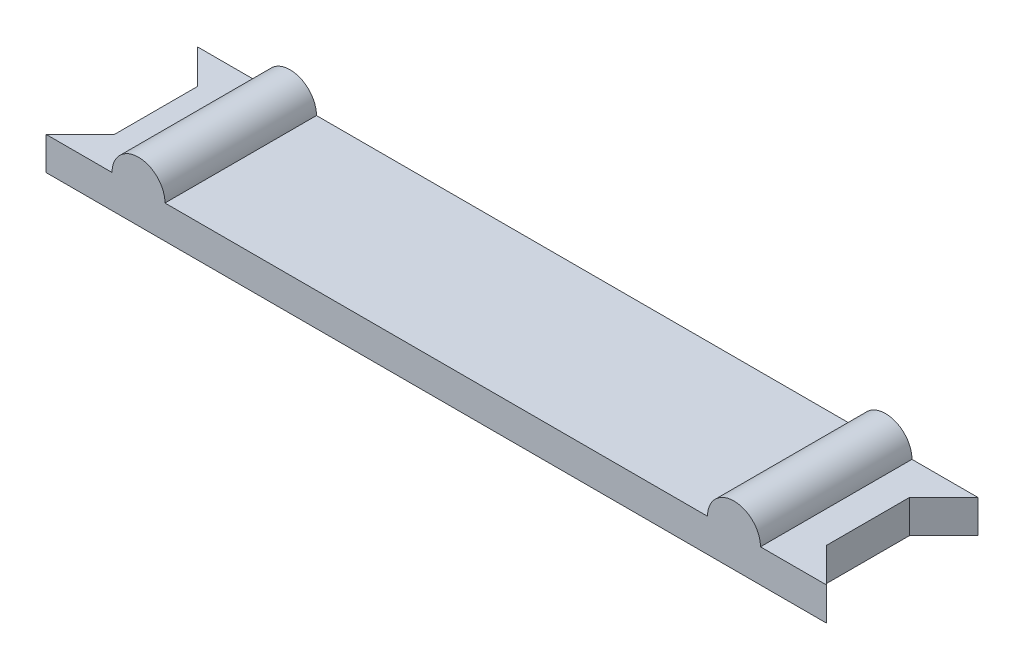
ISO-10303-21;
HEADER;
FILE_DESCRIPTION(('STEP AP214'),'2;1');
FILE_NAME('part.step','',(''),(''),'','','');
FILE_SCHEMA(('AUTOMOTIVE_DESIGN { 1 0 10303 214 1 1 1 1 }'));
ENDSEC;
DATA;
#1=APPLICATION_CONTEXT('core data for automotive mechanical design processes');
#2=APPLICATION_PROTOCOL_DEFINITION('international standard','automotive_design',2000,#1);
#3=PRODUCT_CONTEXT('',#1,'mechanical');
#4=PRODUCT('Part','Part','',(#3));
#5=PRODUCT_RELATED_PRODUCT_CATEGORY('part','',(#4));
#6=PRODUCT_DEFINITION_FORMATION('','',#4);
#7=PRODUCT_DEFINITION_CONTEXT('part definition',#1,'design');
#8=PRODUCT_DEFINITION('design','',#6,#7);
#9=PRODUCT_DEFINITION_SHAPE('','',#8);
#10=(LENGTH_UNIT() NAMED_UNIT(*) SI_UNIT(.MILLI.,.METRE.));
#11=(NAMED_UNIT(*) PLANE_ANGLE_UNIT() SI_UNIT($,.RADIAN.));
#12=(NAMED_UNIT(*) SI_UNIT($,.STERADIAN.) SOLID_ANGLE_UNIT());
#13=UNCERTAINTY_MEASURE_WITH_UNIT(LENGTH_MEASURE(1.E-05),#10,'distance_accuracy_value','');
#14=(GEOMETRIC_REPRESENTATION_CONTEXT(3) GLOBAL_UNCERTAINTY_ASSIGNED_CONTEXT((#13)) GLOBAL_UNIT_ASSIGNED_CONTEXT((#10,
#11,#12)) REPRESENTATION_CONTEXT('',''));
#15=CARTESIAN_POINT('',(0.,0.,0.));
#16=DIRECTION('',(0.,0.,1.));
#17=DIRECTION('',(1.,0.,0.));
#18=AXIS2_PLACEMENT_3D('',#15,#16,#17);
#19=CARTESIAN_POINT('',(0.,2.5,0.));
#20=DIRECTION('',(0.,1.,0.));
#21=DIRECTION('',(0.,0.,1.));
#22=AXIS2_PLACEMENT_3D('',#19,#20,#21);
#23=PLANE('',#22);
#24=DIRECTION('',(0.,0.,1.));
#25=VECTOR('',#24,1.);
#26=CARTESIAN_POINT('',(20.5,2.5,-10.1971359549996));
#27=LINE('',#26,#25);
#28=CARTESIAN_POINT('',(20.5,2.5,-5.725));
#29=VERTEX_POINT('',#28);
#30=CARTESIAN_POINT('',(20.5,2.5,5.725));
#31=VERTEX_POINT('',#30);
#32=EDGE_CURVE('E183',#29,#31,#27,.T.);
#33=ORIENTED_EDGE('',*,*,#32,.F.);
#34=DIRECTION('',(1.,0.,0.));
#35=VECTOR('',#34,1.);
#36=CARTESIAN_POINT('',(0.,2.5,-5.725));
#37=LINE('',#36,#35);
#38=CARTESIAN_POINT('',(-20.5,2.5,-5.725));
#39=VERTEX_POINT('',#38);
#40=EDGE_CURVE('E171',#39,#29,#37,.T.);
#41=ORIENTED_EDGE('',*,*,#40,.F.);
#42=DIRECTION('',(0.,0.,1.));
#43=VECTOR('',#42,1.);
#44=CARTESIAN_POINT('',(-20.5,2.5,-10.1971359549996));
#45=LINE('',#44,#43);
#46=CARTESIAN_POINT('',(-20.5,2.5,5.725));
#47=VERTEX_POINT('',#46);
#48=EDGE_CURVE('E206',#39,#47,#45,.T.);
#49=ORIENTED_EDGE('',*,*,#48,.T.);
#50=DIRECTION('',(1.,0.,0.));
#51=VECTOR('',#50,1.);
#52=CARTESIAN_POINT('',(0.,2.5,5.725));
#53=LINE('',#52,#51);
#54=EDGE_CURVE('E237',#47,#31,#53,.T.);
#55=ORIENTED_EDGE('',*,*,#54,.T.);
#56=EDGE_LOOP('',(#33,#41,#49,#55));
#57=FACE_BOUND('',#56,.T.);
#58=ADVANCED_FACE('F45',(#57),#23,.T.);
#59=DIRECTION('',(0.,0.,1.));
#60=VECTOR('',#59,1.);
#61=CARTESIAN_POINT('',(-24.5,2.5,-10.1971359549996));
#62=LINE('',#61,#60);
#63=CARTESIAN_POINT('',(-24.5,2.5,-5.725));
#64=VERTEX_POINT('',#63);
#65=CARTESIAN_POINT('',(-24.5,2.5,5.725));
#66=VERTEX_POINT('',#65);
#67=EDGE_CURVE('E202',#64,#66,#62,.T.);
#68=ORIENTED_EDGE('',*,*,#67,.F.);
#69=CARTESIAN_POINT('',(-29.4910181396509,2.5,-5.725));
#70=VERTEX_POINT('',#69);
#71=EDGE_CURVE('E173',#70,#64,#37,.T.);
#72=ORIENTED_EDGE('',*,*,#71,.F.);
#73=DIRECTION('',(0.707928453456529,0.,0.706284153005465));
#74=VECTOR('',#73,1.);
#75=CARTESIAN_POINT('',(-11.8487277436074,2.5,11.8763127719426));
#76=LINE('',#75,#74);
#77=CARTESIAN_POINT('',(-26.9,2.5,-3.14));
#78=VERTEX_POINT('',#77);
#79=EDGE_CURVE('E223',#70,#78,#76,.T.);
#80=ORIENTED_EDGE('',*,*,#79,.T.);
#81=DIRECTION('',(0.,0.,1.));
#82=VECTOR('',#81,1.);
#83=CARTESIAN_POINT('',(-26.9,2.5,0.));
#84=LINE('',#83,#82);
#85=CARTESIAN_POINT('',(-26.9,2.5,3.14));
#86=VERTEX_POINT('',#85);
#87=EDGE_CURVE('E226',#78,#86,#84,.T.);
#88=ORIENTED_EDGE('',*,*,#87,.T.);
#89=DIRECTION('',(-0.707928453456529,0.,0.706284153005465));
#90=VECTOR('',#89,1.);
#91=CARTESIAN_POINT('',(-11.8487277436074,2.5,-11.8763127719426));
#92=LINE('',#91,#90);
#93=CARTESIAN_POINT('',(-29.4910181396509,2.5,5.725));
#94=VERTEX_POINT('',#93);
#95=EDGE_CURVE('E229',#86,#94,#92,.T.);
#96=ORIENTED_EDGE('',*,*,#95,.T.);
#97=EDGE_CURVE('E233',#94,#66,#53,.T.);
#98=ORIENTED_EDGE('',*,*,#97,.T.);
#99=EDGE_LOOP('',(#68,#72,#80,#88,#96,#98));
#100=FACE_BOUND('',#99,.T.);
#101=ADVANCED_FACE('F351',(#100),#23,.T.);
#102=CARTESIAN_POINT('',(11.8487277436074,2.5,-11.8763127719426));
#103=DIRECTION('',(0.706284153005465,0.,-0.707928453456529));
#104=DIRECTION('',(-0.707928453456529,0.,-0.706284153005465));
#105=AXIS2_PLACEMENT_3D('',#102,#103,#104);
#106=PLANE('',#105);
#107=DIRECTION('',(0.707928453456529,0.,0.706284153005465));
#108=VECTOR('',#107,1.);
#109=CARTESIAN_POINT('',(11.8487277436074,0.,-11.8763127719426));
#110=LINE('',#109,#108);
#111=CARTESIAN_POINT('',(26.9,0.,3.14));
#112=VERTEX_POINT('',#111);
#113=CARTESIAN_POINT('',(29.4910181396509,0.,5.725));
#114=VERTEX_POINT('',#113);
#115=EDGE_CURVE('E209',#112,#114,#110,.T.);
#116=ORIENTED_EDGE('',*,*,#115,.F.);
#117=DIRECTION('',(0.,-1.,0.));
#118=VECTOR('',#117,1.);
#119=CARTESIAN_POINT('',(26.9,2.5,3.14));
#120=LINE('',#119,#118);
#121=CARTESIAN_POINT('',(26.9,2.5,3.14));
#122=VERTEX_POINT('',#121);
#123=EDGE_CURVE('E288',#122,#112,#120,.T.);
#124=ORIENTED_EDGE('',*,*,#123,.F.);
#125=DIRECTION('',(0.707928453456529,0.,0.706284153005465));
#126=VECTOR('',#125,1.);
#127=CARTESIAN_POINT('',(11.8487277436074,2.5,-11.8763127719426));
#128=LINE('',#127,#126);
#129=CARTESIAN_POINT('',(29.4910181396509,2.5,5.725));
#130=VERTEX_POINT('',#129);
#131=EDGE_CURVE('E210',#122,#130,#128,.T.);
#132=ORIENTED_EDGE('',*,*,#131,.T.);
#133=DIRECTION('',(0.,-1.,0.));
#134=VECTOR('',#133,1.);
#135=CARTESIAN_POINT('',(29.4910181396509,2.5,5.725));
#136=LINE('',#135,#134);
#137=EDGE_CURVE('E236',#130,#114,#136,.T.);
#138=ORIENTED_EDGE('',*,*,#137,.T.);
#139=EDGE_LOOP('',(#116,#124,#132,#138));
#140=FACE_BOUND('',#139,.T.);
#141=ADVANCED_FACE('F364',(#140),#106,.T.);
#142=CARTESIAN_POINT('',(26.9,2.5,0.));
#143=DIRECTION('',(1.,0.,0.));
#144=DIRECTION('',(0.,0.,-1.));
#145=AXIS2_PLACEMENT_3D('',#142,#143,#144);
#146=PLANE('',#145);
#147=DIRECTION('',(0.,0.,1.));
#148=VECTOR('',#147,1.);
#149=CARTESIAN_POINT('',(26.9,0.,0.));
#150=LINE('',#149,#148);
#151=CARTESIAN_POINT('',(26.9,0.,-3.13999999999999));
#152=VERTEX_POINT('',#151);
#153=EDGE_CURVE('E241',#152,#112,#150,.T.);
#154=ORIENTED_EDGE('',*,*,#153,.F.);
#155=DIRECTION('',(0.,-1.,0.));
#156=VECTOR('',#155,1.);
#157=CARTESIAN_POINT('',(26.9,2.5,-3.13999999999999));
#158=LINE('',#157,#156);
#159=CARTESIAN_POINT('',(26.9,2.5,-3.13999999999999));
#160=VERTEX_POINT('',#159);
#161=EDGE_CURVE('E285',#160,#152,#158,.T.);
#162=ORIENTED_EDGE('',*,*,#161,.F.);
#163=DIRECTION('',(0.,0.,1.));
#164=VECTOR('',#163,1.);
#165=CARTESIAN_POINT('',(26.9,2.5,0.));
#166=LINE('',#165,#164);
#167=EDGE_CURVE('E214',#160,#122,#166,.T.);
#168=ORIENTED_EDGE('',*,*,#167,.T.);
#169=ORIENTED_EDGE('',*,*,#123,.T.);
#170=EDGE_LOOP('',(#154,#162,#168,#169));
#171=FACE_BOUND('',#170,.T.);
#172=ADVANCED_FACE('F366',(#171),#146,.T.);
#173=CARTESIAN_POINT('',(11.8487277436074,2.5,11.8763127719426));
#174=DIRECTION('',(0.706284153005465,0.,0.707928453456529));
#175=DIRECTION('',(0.707928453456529,0.,-0.706284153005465));
#176=AXIS2_PLACEMENT_3D('',#173,#174,#175);
#177=PLANE('',#176);
#178=DIRECTION('',(-0.707928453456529,0.,0.706284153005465));
#179=VECTOR('',#178,1.);
#180=CARTESIAN_POINT('',(11.8487277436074,0.,11.8763127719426));
#181=LINE('',#180,#179);
#182=CARTESIAN_POINT('',(29.4910181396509,0.,-5.725));
#183=VERTEX_POINT('',#182);
#184=EDGE_CURVE('E245',#183,#152,#181,.T.);
#185=ORIENTED_EDGE('',*,*,#184,.F.);
#186=DIRECTION('',(0.,-1.,0.));
#187=VECTOR('',#186,1.);
#188=CARTESIAN_POINT('',(29.4910181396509,2.5,-5.725));
#189=LINE('',#188,#187);
#190=CARTESIAN_POINT('',(29.4910181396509,2.5,-5.725));
#191=VERTEX_POINT('',#190);
#192=EDGE_CURVE('E282',#191,#183,#189,.T.);
#193=ORIENTED_EDGE('',*,*,#192,.F.);
#194=DIRECTION('',(-0.707928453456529,0.,0.706284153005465));
#195=VECTOR('',#194,1.);
#196=CARTESIAN_POINT('',(11.8487277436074,2.5,11.8763127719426));
#197=LINE('',#196,#195);
#198=EDGE_CURVE('E167',#191,#160,#197,.T.);
#199=ORIENTED_EDGE('',*,*,#198,.T.);
#200=ORIENTED_EDGE('',*,*,#161,.T.);
#201=EDGE_LOOP('',(#185,#193,#199,#200));
#202=FACE_BOUND('',#201,.T.);
#203=ADVANCED_FACE('F369',(#202),#177,.T.);
#204=CARTESIAN_POINT('',(0.,2.5,-5.725));
#205=DIRECTION('',(0.,0.,-1.));
#206=DIRECTION('',(-1.,0.,0.));
#207=AXIS2_PLACEMENT_3D('',#204,#205,#206);
#208=PLANE('',#207);
#209=DIRECTION('',(1.,0.,0.));
#210=VECTOR('',#209,1.);
#211=CARTESIAN_POINT('',(0.,0.,-5.725));
#212=LINE('',#211,#210);
#213=CARTESIAN_POINT('',(-29.4910181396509,0.,-5.725));
#214=VERTEX_POINT('',#213);
#215=EDGE_CURVE('E249',#214,#183,#212,.T.);
#216=ORIENTED_EDGE('',*,*,#215,.F.);
#217=DIRECTION('',(0.,-1.,0.));
#218=VECTOR('',#217,1.);
#219=CARTESIAN_POINT('',(-29.4910181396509,2.5,-5.725));
#220=LINE('',#219,#218);
#221=EDGE_CURVE('E279',#70,#214,#220,.T.);
#222=ORIENTED_EDGE('',*,*,#221,.F.);
#223=ORIENTED_EDGE('',*,*,#71,.T.);
#224=CARTESIAN_POINT('',(-22.5,2.5,-5.725));
#225=DIRECTION('',(0.,0.,-1.));
#226=DIRECTION('',(-1.,0.,0.));
#227=AXIS2_PLACEMENT_3D('',#224,#225,#226);
#228=CIRCLE('',#227,2.);
#229=EDGE_CURVE('E195',#39,#64,#228,.F.);
#230=ORIENTED_EDGE('',*,*,#229,.F.);
#231=ORIENTED_EDGE('',*,*,#40,.T.);
#232=CARTESIAN_POINT('',(22.5,2.5,-5.725));
#233=DIRECTION('',(0.,0.,-1.));
#234=DIRECTION('',(-1.,0.,0.));
#235=AXIS2_PLACEMENT_3D('',#232,#233,#234);
#236=CIRCLE('',#235,2.);
#237=CARTESIAN_POINT('',(24.5,2.5,-5.725));
#238=VERTEX_POINT('',#237);
#239=EDGE_CURVE('E176',#238,#29,#236,.F.);
#240=ORIENTED_EDGE('',*,*,#239,.F.);
#241=EDGE_CURVE('E159',#238,#191,#37,.T.);
#242=ORIENTED_EDGE('',*,*,#241,.T.);
#243=ORIENTED_EDGE('',*,*,#192,.T.);
#244=EDGE_LOOP('',(#216,#222,#223,#230,#231,#240,#242,#243));
#245=FACE_BOUND('',#244,.T.);
#246=ADVANCED_FACE('F178',(#245),#208,.T.);
#247=CARTESIAN_POINT('',(-11.8487277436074,2.5,11.8763127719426));
#248=DIRECTION('',(0.706284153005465,0.,-0.707928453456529));
#249=DIRECTION('',(-0.707928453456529,0.,-0.706284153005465));
#250=AXIS2_PLACEMENT_3D('',#247,#248,#249);
#251=PLANE('',#250);
#252=DIRECTION('',(0.707928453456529,0.,0.706284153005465));
#253=VECTOR('',#252,1.);
#254=CARTESIAN_POINT('',(-11.8487277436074,0.,11.8763127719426));
#255=LINE('',#254,#253);
#256=CARTESIAN_POINT('',(-26.9,0.,-3.14));
#257=VERTEX_POINT('',#256);
#258=EDGE_CURVE('E253',#214,#257,#255,.T.);
#259=ORIENTED_EDGE('',*,*,#258,.T.);
#260=DIRECTION('',(0.,-1.,0.));
#261=VECTOR('',#260,1.);
#262=CARTESIAN_POINT('',(-26.9,2.5,-3.14));
#263=LINE('',#262,#261);
#264=EDGE_CURVE('E275',#78,#257,#263,.T.);
#265=ORIENTED_EDGE('',*,*,#264,.F.);
#266=ORIENTED_EDGE('',*,*,#79,.F.);
#267=ORIENTED_EDGE('',*,*,#221,.T.);
#268=EDGE_LOOP('',(#259,#265,#266,#267));
#269=FACE_BOUND('',#268,.T.);
#270=ADVANCED_FACE('F373',(#269),#251,.F.);
#271=CARTESIAN_POINT('',(-26.9,2.5,0.));
#272=DIRECTION('',(1.,0.,0.));
#273=DIRECTION('',(0.,0.,-1.));
#274=AXIS2_PLACEMENT_3D('',#271,#272,#273);
#275=PLANE('',#274);
#276=DIRECTION('',(0.,0.,1.));
#277=VECTOR('',#276,1.);
#278=CARTESIAN_POINT('',(-26.9,0.,0.));
#279=LINE('',#278,#277);
#280=CARTESIAN_POINT('',(-26.9,0.,3.14));
#281=VERTEX_POINT('',#280);
#282=EDGE_CURVE('E256',#257,#281,#279,.T.);
#283=ORIENTED_EDGE('',*,*,#282,.T.);
#284=DIRECTION('',(0.,-1.,0.));
#285=VECTOR('',#284,1.);
#286=CARTESIAN_POINT('',(-26.9,2.5,3.14));
#287=LINE('',#286,#285);
#288=EDGE_CURVE('E271',#86,#281,#287,.T.);
#289=ORIENTED_EDGE('',*,*,#288,.F.);
#290=ORIENTED_EDGE('',*,*,#87,.F.);
#291=ORIENTED_EDGE('',*,*,#264,.T.);
#292=EDGE_LOOP('',(#283,#289,#290,#291));
#293=FACE_BOUND('',#292,.T.);
#294=ADVANCED_FACE('F375',(#293),#275,.F.);
#295=CARTESIAN_POINT('',(-11.8487277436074,2.5,-11.8763127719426));
#296=DIRECTION('',(0.706284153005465,0.,0.707928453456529));
#297=DIRECTION('',(0.707928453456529,0.,-0.706284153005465));
#298=AXIS2_PLACEMENT_3D('',#295,#296,#297);
#299=PLANE('',#298);
#300=DIRECTION('',(-0.707928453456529,0.,0.706284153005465));
#301=VECTOR('',#300,1.);
#302=CARTESIAN_POINT('',(-11.8487277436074,0.,-11.8763127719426));
#303=LINE('',#302,#301);
#304=CARTESIAN_POINT('',(-29.4910181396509,0.,5.725));
#305=VERTEX_POINT('',#304);
#306=EDGE_CURVE('E259',#281,#305,#303,.T.);
#307=ORIENTED_EDGE('',*,*,#306,.T.);
#308=DIRECTION('',(0.,-1.,0.));
#309=VECTOR('',#308,1.);
#310=CARTESIAN_POINT('',(-29.4910181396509,2.5,5.725));
#311=LINE('',#310,#309);
#312=EDGE_CURVE('E267',#94,#305,#311,.T.);
#313=ORIENTED_EDGE('',*,*,#312,.F.);
#314=ORIENTED_EDGE('',*,*,#95,.F.);
#315=ORIENTED_EDGE('',*,*,#288,.T.);
#316=EDGE_LOOP('',(#307,#313,#314,#315));
#317=FACE_BOUND('',#316,.T.);
#318=ADVANCED_FACE('F357',(#317),#299,.F.);
#319=CARTESIAN_POINT('',(0.,2.5,5.725));
#320=DIRECTION('',(0.,0.,-1.));
#321=DIRECTION('',(-1.,0.,0.));
#322=AXIS2_PLACEMENT_3D('',#319,#320,#321);
#323=PLANE('',#322);
#324=DIRECTION('',(1.,0.,0.));
#325=VECTOR('',#324,1.);
#326=CARTESIAN_POINT('',(0.,0.,5.725));
#327=LINE('',#326,#325);
#328=EDGE_CURVE('E215',#305,#114,#327,.T.);
#329=ORIENTED_EDGE('',*,*,#328,.T.);
#330=ORIENTED_EDGE('',*,*,#137,.F.);
#331=CARTESIAN_POINT('',(24.5,2.5,5.725));
#332=VERTEX_POINT('',#331);
#333=EDGE_CURVE('E232',#332,#130,#53,.T.);
#334=ORIENTED_EDGE('',*,*,#333,.F.);
#335=CARTESIAN_POINT('',(22.5,2.5,5.725));
#336=DIRECTION('',(0.,0.,1.));
#337=DIRECTION('',(1.,0.,0.));
#338=AXIS2_PLACEMENT_3D('',#335,#336,#337);
#339=CIRCLE('',#338,2.);
#340=EDGE_CURVE('E184',#332,#31,#339,.T.);
#341=ORIENTED_EDGE('',*,*,#340,.T.);
#342=ORIENTED_EDGE('',*,*,#54,.F.);
#343=CARTESIAN_POINT('',(-22.5,2.5,5.725));
#344=DIRECTION('',(0.,0.,1.));
#345=DIRECTION('',(1.,0.,0.));
#346=AXIS2_PLACEMENT_3D('',#343,#344,#345);
#347=CIRCLE('',#346,2.);
#348=EDGE_CURVE('E190',#47,#66,#347,.T.);
#349=ORIENTED_EDGE('',*,*,#348,.T.);
#350=ORIENTED_EDGE('',*,*,#97,.F.);
#351=ORIENTED_EDGE('',*,*,#312,.T.);
#352=EDGE_LOOP('',(#329,#330,#334,#341,#342,#349,#350,#351));
#353=FACE_BOUND('',#352,.T.);
#354=ADVANCED_FACE('F337',(#353),#323,.F.);
#355=DIRECTION('',(0.,0.,1.));
#356=VECTOR('',#355,1.);
#357=CARTESIAN_POINT('',(24.5,2.5,-10.1971359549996));
#358=LINE('',#357,#356);
#359=EDGE_CURVE('E163',#238,#332,#358,.T.);
#360=ORIENTED_EDGE('',*,*,#359,.T.);
#361=ORIENTED_EDGE('',*,*,#333,.T.);
#362=ORIENTED_EDGE('',*,*,#131,.F.);
#363=ORIENTED_EDGE('',*,*,#167,.F.);
#364=ORIENTED_EDGE('',*,*,#198,.F.);
#365=ORIENTED_EDGE('',*,*,#241,.F.);
#366=EDGE_LOOP('',(#360,#361,#362,#363,#364,#365));
#367=FACE_BOUND('',#366,.T.);
#368=ADVANCED_FACE('F161',(#367),#23,.T.);
#369=CARTESIAN_POINT('',(0.,0.,0.));
#370=DIRECTION('',(0.,1.,0.));
#371=DIRECTION('',(0.,0.,1.));
#372=AXIS2_PLACEMENT_3D('',#369,#370,#371);
#373=PLANE('',#372);
#374=DIRECTION('',(-1.,0.,0.));
#375=VECTOR('',#374,1.);
#376=CARTESIAN_POINT('',(-7.5,0.,0.));
#377=LINE('',#376,#375);
#378=CARTESIAN_POINT('',(9.50000000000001,0.,0.));
#379=VERTEX_POINT('',#378);
#380=CARTESIAN_POINT('',(-9.50000000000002,0.,0.));
#381=VERTEX_POINT('',#380);
#382=EDGE_CURVE('E323',#379,#381,#377,.T.);
#383=ORIENTED_EDGE('',*,*,#382,.F.);
#384=DIRECTION('',(0.,0.,-1.));
#385=VECTOR('',#384,1.);
#386=CARTESIAN_POINT('',(9.50000000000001,0.,0.));
#387=LINE('',#386,#385);
#388=CARTESIAN_POINT('',(9.50000000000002,0.,-3.2));
#389=VERTEX_POINT('',#388);
#390=EDGE_CURVE('E295',#379,#389,#387,.T.);
#391=ORIENTED_EDGE('',*,*,#390,.T.);
#392=DIRECTION('',(1.,0.,0.));
#393=VECTOR('',#392,1.);
#394=CARTESIAN_POINT('',(-7.5,0.,-3.2));
#395=LINE('',#394,#393);
#396=CARTESIAN_POINT('',(-9.50000000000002,0.,-3.2));
#397=VERTEX_POINT('',#396);
#398=EDGE_CURVE('E315',#397,#389,#395,.T.);
#399=ORIENTED_EDGE('',*,*,#398,.F.);
#400=DIRECTION('',(0.,0.,1.));
#401=VECTOR('',#400,1.);
#402=CARTESIAN_POINT('',(-9.50000000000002,0.,0.));
#403=LINE('',#402,#401);
#404=EDGE_CURVE('E291',#397,#381,#403,.T.);
#405=ORIENTED_EDGE('',*,*,#404,.T.);
#406=EDGE_LOOP('',(#383,#391,#399,#405));
#407=FACE_BOUND('',#406,.T.);
#408=ORIENTED_EDGE('',*,*,#115,.T.);
#409=ORIENTED_EDGE('',*,*,#328,.F.);
#410=ORIENTED_EDGE('',*,*,#306,.F.);
#411=ORIENTED_EDGE('',*,*,#282,.F.);
#412=ORIENTED_EDGE('',*,*,#258,.F.);
#413=ORIENTED_EDGE('',*,*,#215,.T.);
#414=ORIENTED_EDGE('',*,*,#184,.T.);
#415=ORIENTED_EDGE('',*,*,#153,.T.);
#416=EDGE_LOOP('',(#408,#409,#410,#411,#412,#413,#414,#415));
#417=FACE_BOUND('',#416,.T.);
#418=ADVANCED_FACE('F321',(#407,#417),#373,.F.);
#419=CARTESIAN_POINT('',(-22.5,2.5,-10.1971359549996));
#420=DIRECTION('',(0.,0.,1.));
#421=DIRECTION('',(1.,0.,0.));
#422=AXIS2_PLACEMENT_3D('',#419,#420,#421);
#423=CYLINDRICAL_SURFACE('',#422,2.);
#424=ORIENTED_EDGE('',*,*,#48,.F.);
#425=ORIENTED_EDGE('',*,*,#229,.T.);
#426=ORIENTED_EDGE('',*,*,#67,.T.);
#427=ORIENTED_EDGE('',*,*,#348,.F.);
#428=EDGE_LOOP('',(#424,#425,#426,#427));
#429=FACE_BOUND('',#428,.T.);
#430=ADVANCED_FACE('F346',(#429),#423,.T.);
#431=CARTESIAN_POINT('',(22.5,2.5,-10.1971359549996));
#432=DIRECTION('',(0.,0.,1.));
#433=DIRECTION('',(1.,0.,0.));
#434=AXIS2_PLACEMENT_3D('',#431,#432,#433);
#435=CYLINDRICAL_SURFACE('',#434,2.);
#436=ORIENTED_EDGE('',*,*,#359,.F.);
#437=ORIENTED_EDGE('',*,*,#239,.T.);
#438=ORIENTED_EDGE('',*,*,#32,.T.);
#439=ORIENTED_EDGE('',*,*,#340,.F.);
#440=EDGE_LOOP('',(#436,#437,#438,#439));
#441=FACE_BOUND('',#440,.T.);
#442=ADVANCED_FACE('F187',(#441),#435,.T.);
#443=CARTESIAN_POINT('',(0.,1.5,0.));
#444=DIRECTION('',(0.,1.,0.));
#445=DIRECTION('',(0.,0.,1.));
#446=AXIS2_PLACEMENT_3D('',#443,#444,#445);
#447=PLANE('',#446);
#448=DIRECTION('',(1.,0.,0.));
#449=VECTOR('',#448,1.);
#450=CARTESIAN_POINT('',(-7.5,1.5,-3.2));
#451=LINE('',#450,#449);
#452=CARTESIAN_POINT('',(-8.00000000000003,1.5,-3.2));
#453=VERTEX_POINT('',#452);
#454=CARTESIAN_POINT('',(8.00000000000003,1.5,-3.2));
#455=VERTEX_POINT('',#454);
#456=EDGE_CURVE('E70',#453,#455,#451,.T.);
#457=ORIENTED_EDGE('',*,*,#456,.T.);
#458=DIRECTION('',(0.,0.,-1.));
#459=VECTOR('',#458,1.);
#460=CARTESIAN_POINT('',(8.00000000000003,1.5,0.));
#461=LINE('',#460,#459);
#462=CARTESIAN_POINT('',(8.00000000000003,1.5,0.));
#463=VERTEX_POINT('',#462);
#464=EDGE_CURVE('E299',#455,#463,#461,.F.);
#465=ORIENTED_EDGE('',*,*,#464,.T.);
#466=DIRECTION('',(-1.,0.,0.));
#467=VECTOR('',#466,1.);
#468=CARTESIAN_POINT('',(-7.5,1.5,0.));
#469=LINE('',#468,#467);
#470=CARTESIAN_POINT('',(-8.00000000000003,1.5,0.));
#471=VERTEX_POINT('',#470);
#472=EDGE_CURVE('E62',#463,#471,#469,.T.);
#473=ORIENTED_EDGE('',*,*,#472,.T.);
#474=DIRECTION('',(0.,0.,1.));
#475=VECTOR('',#474,1.);
#476=CARTESIAN_POINT('',(-8.00000000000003,1.5,0.));
#477=LINE('',#476,#475);
#478=EDGE_CURVE('E309',#471,#453,#477,.F.);
#479=ORIENTED_EDGE('',*,*,#478,.T.);
#480=EDGE_LOOP('',(#457,#465,#473,#479));
#481=FACE_BOUND('',#480,.T.);
#482=ADVANCED_FACE('F476',(#481),#447,.F.);
#483=CARTESIAN_POINT('',(-7.5,17.8375356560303,0.));
#484=DIRECTION('',(0.,0.,1.));
#485=DIRECTION('',(1.,0.,0.));
#486=AXIS2_PLACEMENT_3D('',#483,#484,#485);
#487=PLANE('',#486);
#488=ORIENTED_EDGE('',*,*,#472,.F.);
#489=DIRECTION('',(-0.707106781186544,0.707106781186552,0.));
#490=VECTOR('',#489,1.);
#491=CARTESIAN_POINT('',(-7.91876782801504,17.4187678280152,0.));
#492=LINE('',#491,#490);
#493=EDGE_CURVE('E302',#463,#379,#492,.F.);
#494=ORIENTED_EDGE('',*,*,#493,.T.);
#495=ORIENTED_EDGE('',*,*,#382,.T.);
#496=DIRECTION('',(-0.707106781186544,-0.707106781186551,0.));
#497=VECTOR('',#496,1.);
#498=CARTESIAN_POINT('',(0.418767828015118,9.91876782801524,0.));
#499=LINE('',#498,#497);
#500=EDGE_CURVE('E12',#381,#471,#499,.F.);
#501=ORIENTED_EDGE('',*,*,#500,.T.);
#502=EDGE_LOOP('',(#488,#494,#495,#501));
#503=FACE_BOUND('',#502,.T.);
#504=ADVANCED_FACE('F472',(#503),#487,.F.);
#505=CARTESIAN_POINT('',(-7.5,17.8375356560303,-3.2));
#506=DIRECTION('',(0.,0.,-1.));
#507=DIRECTION('',(-1.,0.,0.));
#508=AXIS2_PLACEMENT_3D('',#505,#506,#507);
#509=PLANE('',#508);
#510=ORIENTED_EDGE('',*,*,#456,.F.);
#511=DIRECTION('',(0.707106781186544,0.707106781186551,0.));
#512=VECTOR('',#511,1.);
#513=CARTESIAN_POINT('',(0.418767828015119,9.91876782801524,-3.2));
#514=LINE('',#513,#512);
#515=EDGE_CURVE('E55',#453,#397,#514,.F.);
#516=ORIENTED_EDGE('',*,*,#515,.T.);
#517=ORIENTED_EDGE('',*,*,#398,.T.);
#518=DIRECTION('',(0.707106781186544,-0.707106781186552,0.));
#519=VECTOR('',#518,1.);
#520=CARTESIAN_POINT('',(-7.91876782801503,17.4187678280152,-3.2));
#521=LINE('',#520,#519);
#522=EDGE_CURVE('E306',#389,#455,#521,.F.);
#523=ORIENTED_EDGE('',*,*,#522,.T.);
#524=EDGE_LOOP('',(#510,#516,#517,#523));
#525=FACE_BOUND('',#524,.T.);
#526=ADVANCED_FACE('F314',(#525),#509,.F.);
#527=CARTESIAN_POINT('',(7.5,2.00000000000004,-3.2));
#528=DIRECTION('',(0.707106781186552,0.707106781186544,0.));
#529=DIRECTION('',(0.,0.,1.));
#530=AXIS2_PLACEMENT_3D('',#527,#528,#529);
#531=PLANE('',#530);
#532=ORIENTED_EDGE('',*,*,#522,.F.);
#533=ORIENTED_EDGE('',*,*,#390,.F.);
#534=ORIENTED_EDGE('',*,*,#493,.F.);
#535=ORIENTED_EDGE('',*,*,#464,.F.);
#536=EDGE_LOOP('',(#532,#533,#534,#535));
#537=FACE_BOUND('',#536,.T.);
#538=ADVANCED_FACE('F463',(#537),#531,.F.);
#539=CARTESIAN_POINT('',(-7.5,2.00000000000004,-3.2));
#540=DIRECTION('',(-0.707106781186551,0.707106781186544,0.));
#541=DIRECTION('',(0.,0.,-1.));
#542=AXIS2_PLACEMENT_3D('',#539,#540,#541);
#543=PLANE('',#542);
#544=ORIENTED_EDGE('',*,*,#500,.F.);
#545=ORIENTED_EDGE('',*,*,#404,.F.);
#546=ORIENTED_EDGE('',*,*,#515,.F.);
#547=ORIENTED_EDGE('',*,*,#478,.F.);
#548=EDGE_LOOP('',(#544,#545,#546,#547));
#549=FACE_BOUND('',#548,.T.);
#550=ADVANCED_FACE('F48',(#549),#543,.F.);
#551=CLOSED_SHELL('',(#58,#101,#141,#172,#203,#246,#270,#294,#318,#354,#368,#418,#430,#442,#482,
#504,#526,#538,#550));
#552=MANIFOLD_SOLID_BREP('B2',#551);
#553=ADVANCED_BREP_SHAPE_REPRESENTATION('',(#18,#552),#14);
#554=SHAPE_DEFINITION_REPRESENTATION(#9,#553);
ENDSEC;
END-ISO-10303-21;
